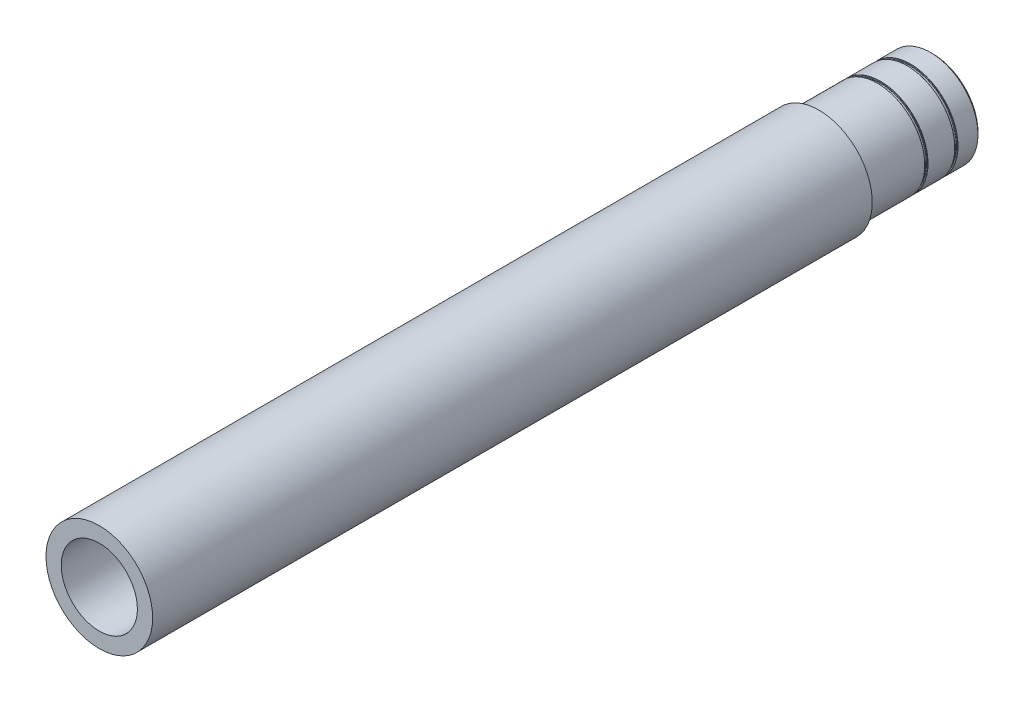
ISO-10303-21;
HEADER;
FILE_DESCRIPTION(('STEP AP214'),'2;1');
FILE_NAME('part.step','',(''),(''),'','','');
FILE_SCHEMA(('AUTOMOTIVE_DESIGN { 1 0 10303 214 1 1 1 1 }'));
ENDSEC;
DATA;
#1=APPLICATION_CONTEXT('core data for automotive mechanical design processes');
#2=APPLICATION_PROTOCOL_DEFINITION('international standard','automotive_design',2000,#1);
#3=PRODUCT_CONTEXT('',#1,'mechanical');
#4=PRODUCT('Part','Part','',(#3));
#5=PRODUCT_RELATED_PRODUCT_CATEGORY('part','',(#4));
#6=PRODUCT_DEFINITION_FORMATION('','',#4);
#7=PRODUCT_DEFINITION_CONTEXT('part definition',#1,'design');
#8=PRODUCT_DEFINITION('design','',#6,#7);
#9=PRODUCT_DEFINITION_SHAPE('','',#8);
#10=(LENGTH_UNIT() NAMED_UNIT(*) SI_UNIT(.MILLI.,.METRE.));
#11=(NAMED_UNIT(*) PLANE_ANGLE_UNIT() SI_UNIT($,.RADIAN.));
#12=(NAMED_UNIT(*) SI_UNIT($,.STERADIAN.) SOLID_ANGLE_UNIT());
#13=UNCERTAINTY_MEASURE_WITH_UNIT(LENGTH_MEASURE(1.E-05),#10,'distance_accuracy_value','');
#14=(GEOMETRIC_REPRESENTATION_CONTEXT(3) GLOBAL_UNCERTAINTY_ASSIGNED_CONTEXT((#13)) GLOBAL_UNIT_ASSIGNED_CONTEXT((#10,
#11,#12)) REPRESENTATION_CONTEXT('',''));
#15=CARTESIAN_POINT('',(0.,0.,0.));
#16=DIRECTION('',(0.,0.,1.));
#17=DIRECTION('',(1.,0.,0.));
#18=AXIS2_PLACEMENT_3D('',#15,#16,#17);
#19=CARTESIAN_POINT('',(0.,0.,100.));
#20=DIRECTION('',(0.,0.,-1.));
#21=DIRECTION('',(-1.,0.,0.));
#22=AXIS2_PLACEMENT_3D('',#19,#20,#21);
#23=CYLINDRICAL_SURFACE('',#22,39.6);
#24=CARTESIAN_POINT('',(0.,0.,6.99999999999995));
#25=DIRECTION('',(0.,0.,1.));
#26=DIRECTION('',(1.,0.,0.));
#27=AXIS2_PLACEMENT_3D('',#24,#25,#26);
#28=CIRCLE('',#27,39.6);
#29=CARTESIAN_POINT('',(39.6,0.,6.99999999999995));
#30=VERTEX_POINT('',#29);
#31=EDGE_CURVE('E11',#30,#30,#28,.T.);
#32=ORIENTED_EDGE('',*,*,#31,.T.);
#33=EDGE_LOOP('',(#32));
#34=FACE_BOUND('',#33,.T.);
#35=CARTESIAN_POINT('',(0.,0.,23.6411));
#36=DIRECTION('',(0.,0.,1.));
#37=DIRECTION('',(1.,0.,0.));
#38=AXIS2_PLACEMENT_3D('',#35,#36,#37);
#39=CIRCLE('',#38,39.6);
#40=CARTESIAN_POINT('',(39.6,0.,23.6411));
#41=VERTEX_POINT('',#40);
#42=EDGE_CURVE('E63',#41,#41,#39,.F.);
#43=ORIENTED_EDGE('',*,*,#42,.T.);
#44=EDGE_LOOP('',(#43));
#45=FACE_BOUND('',#44,.T.);
#46=ADVANCED_FACE('F33',(#34,#45),#23,.T.);
#47=CARTESIAN_POINT('',(0.,0.,26.3589));
#48=DIRECTION('',(0.,0.,-1.));
#49=DIRECTION('',(-1.,0.,0.));
#50=AXIS2_PLACEMENT_3D('',#47,#48,#49);
#51=CIRCLE('',#50,39.6);
#52=CARTESIAN_POINT('',(-39.6,0.,26.3589));
#53=VERTEX_POINT('',#52);
#54=EDGE_CURVE('E69',#53,#53,#51,.F.);
#55=ORIENTED_EDGE('',*,*,#54,.T.);
#56=EDGE_LOOP('',(#55));
#57=FACE_BOUND('',#56,.T.);
#58=CARTESIAN_POINT('',(0.,0.,48.6411));
#59=DIRECTION('',(0.,0.,1.));
#60=DIRECTION('',(1.,0.,0.));
#61=AXIS2_PLACEMENT_3D('',#58,#59,#60);
#62=CIRCLE('',#61,39.6);
#63=CARTESIAN_POINT('',(39.6,0.,48.6411));
#64=VERTEX_POINT('',#63);
#65=EDGE_CURVE('E72',#64,#64,#62,.F.);
#66=ORIENTED_EDGE('',*,*,#65,.T.);
#67=EDGE_LOOP('',(#66));
#68=FACE_BOUND('',#67,.T.);
#69=ADVANCED_FACE('F129',(#57,#68),#23,.T.);
#70=CARTESIAN_POINT('',(0.,0.,51.3589));
#71=DIRECTION('',(0.,0.,-1.));
#72=DIRECTION('',(-1.,0.,0.));
#73=AXIS2_PLACEMENT_3D('',#70,#71,#72);
#74=CIRCLE('',#73,39.6);
#75=CARTESIAN_POINT('',(-39.6,0.,51.3589));
#76=VERTEX_POINT('',#75);
#77=EDGE_CURVE('E48',#76,#76,#74,.F.);
#78=ORIENTED_EDGE('',*,*,#77,.T.);
#79=EDGE_LOOP('',(#78));
#80=FACE_BOUND('',#79,.T.);
#81=CARTESIAN_POINT('',(0.,0.,100.));
#82=DIRECTION('',(0.,0.,-1.));
#83=DIRECTION('',(-1.,0.,0.));
#84=AXIS2_PLACEMENT_3D('',#81,#82,#83);
#85=CIRCLE('',#84,39.6);
#86=CARTESIAN_POINT('',(-39.6,0.,100.));
#87=VERTEX_POINT('',#86);
#88=EDGE_CURVE('E80',#87,#87,#85,.T.);
#89=ORIENTED_EDGE('',*,*,#88,.T.);
#90=EDGE_LOOP('',(#89));
#91=FACE_BOUND('',#90,.T.);
#92=ADVANCED_FACE('F131',(#80,#91),#23,.T.);
#93=CARTESIAN_POINT('',(0.,0.,700.));
#94=DIRECTION('',(0.,0.,-1.));
#95=DIRECTION('',(-1.,0.,0.));
#96=AXIS2_PLACEMENT_3D('',#93,#94,#95);
#97=CYLINDRICAL_SURFACE('',#96,44.45);
#98=CARTESIAN_POINT('',(0.,0.,700.));
#99=DIRECTION('',(0.,0.,1.));
#100=DIRECTION('',(1.,0.,0.));
#101=AXIS2_PLACEMENT_3D('',#98,#99,#100);
#102=CIRCLE('',#101,44.45);
#103=CARTESIAN_POINT('',(44.45,0.,700.));
#104=VERTEX_POINT('',#103);
#105=EDGE_CURVE('E75',#104,#104,#102,.T.);
#106=ORIENTED_EDGE('',*,*,#105,.F.);
#107=EDGE_LOOP('',(#106));
#108=FACE_BOUND('',#107,.T.);
#109=CARTESIAN_POINT('',(0.,0.,100.));
#110=DIRECTION('',(0.,0.,-1.));
#111=DIRECTION('',(-1.,0.,0.));
#112=AXIS2_PLACEMENT_3D('',#109,#110,#111);
#113=CIRCLE('',#112,44.45);
#114=CARTESIAN_POINT('',(-44.45,0.,100.));
#115=VERTEX_POINT('',#114);
#116=EDGE_CURVE('E76',#115,#115,#113,.T.);
#117=ORIENTED_EDGE('',*,*,#116,.F.);
#118=EDGE_LOOP('',(#117));
#119=FACE_BOUND('',#118,.T.);
#120=ADVANCED_FACE('F140',(#108,#119),#97,.T.);
#121=CARTESIAN_POINT('',(0.,0.,700.));
#122=DIRECTION('',(0.,0.,1.));
#123=DIRECTION('',(1.,0.,0.));
#124=AXIS2_PLACEMENT_3D('',#121,#122,#123);
#125=PLANE('',#124);
#126=ORIENTED_EDGE('',*,*,#105,.T.);
#127=EDGE_LOOP('',(#126));
#128=FACE_BOUND('',#127,.T.);
#129=CARTESIAN_POINT('',(0.,0.,700.));
#130=DIRECTION('',(0.,0.,1.));
#131=DIRECTION('',(1.,0.,0.));
#132=AXIS2_PLACEMENT_3D('',#129,#130,#131);
#133=CIRCLE('',#132,31.75);
#134=CARTESIAN_POINT('',(31.75,0.,700.));
#135=VERTEX_POINT('',#134);
#136=EDGE_CURVE('E79',#135,#135,#133,.T.);
#137=ORIENTED_EDGE('',*,*,#136,.F.);
#138=EDGE_LOOP('',(#137));
#139=FACE_BOUND('',#138,.T.);
#140=ADVANCED_FACE('F145',(#128,#139),#125,.T.);
#141=CARTESIAN_POINT('',(0.,0.,700.));
#142=DIRECTION('',(0.,0.,-1.));
#143=DIRECTION('',(-1.,0.,0.));
#144=AXIS2_PLACEMENT_3D('',#141,#142,#143);
#145=CYLINDRICAL_SURFACE('',#144,31.75);
#146=CARTESIAN_POINT('',(0.,0.,5.));
#147=DIRECTION('',(0.,0.,1.));
#148=DIRECTION('',(1.,0.,0.));
#149=AXIS2_PLACEMENT_3D('',#146,#147,#148);
#150=CIRCLE('',#149,31.75);
#151=CARTESIAN_POINT('',(31.75,0.,5.));
#152=VERTEX_POINT('',#151);
#153=EDGE_CURVE('E51',#152,#152,#150,.T.);
#154=ORIENTED_EDGE('',*,*,#153,.F.);
#155=EDGE_LOOP('',(#154));
#156=FACE_BOUND('',#155,.T.);
#157=ORIENTED_EDGE('',*,*,#136,.T.);
#158=EDGE_LOOP('',(#157));
#159=FACE_BOUND('',#158,.T.);
#160=ADVANCED_FACE('F156',(#156,#159),#145,.F.);
#161=CARTESIAN_POINT('',(0.,0.,100.));
#162=DIRECTION('',(0.,0.,-1.));
#163=DIRECTION('',(-1.,0.,0.));
#164=AXIS2_PLACEMENT_3D('',#161,#162,#163);
#165=PLANE('',#164);
#166=ORIENTED_EDGE('',*,*,#88,.F.);
#167=EDGE_LOOP('',(#166));
#168=FACE_BOUND('',#167,.T.);
#169=ORIENTED_EDGE('',*,*,#116,.T.);
#170=EDGE_LOOP('',(#169));
#171=FACE_BOUND('',#170,.T.);
#172=ADVANCED_FACE('F152',(#168,#171),#165,.T.);
#173=CARTESIAN_POINT('',(0.,40.8446,48.8189));
#174=DIRECTION('',(0.,0.,1.));
#175=DIRECTION('',(1.,0.,0.));
#176=AXIS2_PLACEMENT_3D('',#173,#174,#175);
#177=PLANE('',#176);
#178=CARTESIAN_POINT('',(0.,0.,48.8189));
#179=DIRECTION('',(0.,0.,1.));
#180=DIRECTION('',(1.,0.,0.));
#181=AXIS2_PLACEMENT_3D('',#178,#179,#180);
#182=CIRCLE('',#181,39.4222);
#183=CARTESIAN_POINT('',(39.4222,0.,48.8189));
#184=VERTEX_POINT('',#183);
#185=EDGE_CURVE('E57',#184,#184,#182,.T.);
#186=ORIENTED_EDGE('',*,*,#185,.T.);
#187=EDGE_LOOP('',(#186));
#188=FACE_BOUND('',#187,.T.);
#189=CARTESIAN_POINT('',(0.,0.,48.8189));
#190=DIRECTION('',(0.,0.,1.));
#191=DIRECTION('',(1.,0.,0.));
#192=AXIS2_PLACEMENT_3D('',#189,#190,#191);
#193=CIRCLE('',#192,38.6094);
#194=CARTESIAN_POINT('',(38.6094,0.,48.8189));
#195=VERTEX_POINT('',#194);
#196=EDGE_CURVE('E87',#195,#195,#193,.T.);
#197=ORIENTED_EDGE('',*,*,#196,.F.);
#198=EDGE_LOOP('',(#197));
#199=FACE_BOUND('',#198,.T.);
#200=ADVANCED_FACE('F155',(#188,#199),#177,.T.);
#201=CARTESIAN_POINT('',(0.,0.,49.0729));
#202=DIRECTION('',(0.,0.,1.));
#203=DIRECTION('',(1.,0.,0.));
#204=AXIS2_PLACEMENT_3D('',#201,#202,#203);
#205=TOROIDAL_SURFACE('',#204,38.6094,0.253999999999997);
#206=ORIENTED_EDGE('',*,*,#196,.T.);
#207=EDGE_LOOP('',(#206));
#208=FACE_BOUND('',#207,.T.);
#209=CARTESIAN_POINT('',(0.,0.,49.0729));
#210=DIRECTION('',(0.,0.,1.));
#211=DIRECTION('',(1.,0.,0.));
#212=AXIS2_PLACEMENT_3D('',#209,#210,#211);
#213=CIRCLE('',#212,38.3554);
#214=CARTESIAN_POINT('',(38.3554,0.,49.0729));
#215=VERTEX_POINT('',#214);
#216=EDGE_CURVE('E90',#215,#215,#213,.T.);
#217=ORIENTED_EDGE('',*,*,#216,.F.);
#218=EDGE_LOOP('',(#217));
#219=FACE_BOUND('',#218,.T.);
#220=ADVANCED_FACE('F163',(#208,#219),#205,.F.);
#221=CARTESIAN_POINT('',(0.,0.,700.));
#222=DIRECTION('',(0.,0.,1.));
#223=DIRECTION('',(1.,0.,0.));
#224=AXIS2_PLACEMENT_3D('',#221,#222,#223);
#225=CYLINDRICAL_SURFACE('',#224,38.3554);
#226=ORIENTED_EDGE('',*,*,#216,.T.);
#227=EDGE_LOOP('',(#226));
#228=FACE_BOUND('',#227,.T.);
#229=CARTESIAN_POINT('',(0.,0.,50.9271));
#230=DIRECTION('',(0.,0.,1.));
#231=DIRECTION('',(1.,0.,0.));
#232=AXIS2_PLACEMENT_3D('',#229,#230,#231);
#233=CIRCLE('',#232,38.3554);
#234=CARTESIAN_POINT('',(38.3554,0.,50.9271));
#235=VERTEX_POINT('',#234);
#236=EDGE_CURVE('E93',#235,#235,#233,.T.);
#237=ORIENTED_EDGE('',*,*,#236,.F.);
#238=EDGE_LOOP('',(#237));
#239=FACE_BOUND('',#238,.T.);
#240=ADVANCED_FACE('F201',(#228,#239),#225,.T.);
#241=CARTESIAN_POINT('',(0.,0.,50.9271));
#242=DIRECTION('',(0.,0.,1.));
#243=DIRECTION('',(1.,0.,0.));
#244=AXIS2_PLACEMENT_3D('',#241,#242,#243);
#245=TOROIDAL_SURFACE('',#244,38.6094,0.253999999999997);
#246=ORIENTED_EDGE('',*,*,#236,.T.);
#247=EDGE_LOOP('',(#246));
#248=FACE_BOUND('',#247,.T.);
#249=CARTESIAN_POINT('',(0.,0.,51.1811));
#250=DIRECTION('',(0.,0.,1.));
#251=DIRECTION('',(1.,0.,0.));
#252=AXIS2_PLACEMENT_3D('',#249,#250,#251);
#253=CIRCLE('',#252,38.6094);
#254=CARTESIAN_POINT('',(38.6094,0.,51.1811));
#255=VERTEX_POINT('',#254);
#256=EDGE_CURVE('E96',#255,#255,#253,.T.);
#257=ORIENTED_EDGE('',*,*,#256,.F.);
#258=EDGE_LOOP('',(#257));
#259=FACE_BOUND('',#258,.T.);
#260=ADVANCED_FACE('F196',(#248,#259),#245,.F.);
#261=CARTESIAN_POINT('',(0.,40.8446,51.1811));
#262=DIRECTION('',(0.,0.,-1.));
#263=DIRECTION('',(-1.,0.,0.));
#264=AXIS2_PLACEMENT_3D('',#261,#262,#263);
#265=PLANE('',#264);
#266=CARTESIAN_POINT('',(0.,0.,51.1811));
#267=DIRECTION('',(0.,0.,-1.));
#268=DIRECTION('',(-1.,0.,0.));
#269=AXIS2_PLACEMENT_3D('',#266,#267,#268);
#270=CIRCLE('',#269,39.4222);
#271=CARTESIAN_POINT('',(-39.4222,0.,51.1811));
#272=VERTEX_POINT('',#271);
#273=EDGE_CURVE('E44',#272,#272,#270,.T.);
#274=ORIENTED_EDGE('',*,*,#273,.T.);
#275=EDGE_LOOP('',(#274));
#276=FACE_BOUND('',#275,.T.);
#277=ORIENTED_EDGE('',*,*,#256,.T.);
#278=EDGE_LOOP('',(#277));
#279=FACE_BOUND('',#278,.T.);
#280=ADVANCED_FACE('F192',(#276,#279),#265,.T.);
#281=CARTESIAN_POINT('',(0.,40.8446,23.8189));
#282=DIRECTION('',(0.,0.,1.));
#283=DIRECTION('',(1.,0.,0.));
#284=AXIS2_PLACEMENT_3D('',#281,#282,#283);
#285=PLANE('',#284);
#286=CARTESIAN_POINT('',(0.,0.,23.8189));
#287=DIRECTION('',(0.,0.,1.));
#288=DIRECTION('',(1.,0.,0.));
#289=AXIS2_PLACEMENT_3D('',#286,#287,#288);
#290=CIRCLE('',#289,39.4222);
#291=CARTESIAN_POINT('',(39.4222,0.,23.8189));
#292=VERTEX_POINT('',#291);
#293=EDGE_CURVE('E60',#292,#292,#290,.T.);
#294=ORIENTED_EDGE('',*,*,#293,.T.);
#295=EDGE_LOOP('',(#294));
#296=FACE_BOUND('',#295,.T.);
#297=CARTESIAN_POINT('',(0.,0.,23.8189));
#298=DIRECTION('',(0.,0.,1.));
#299=DIRECTION('',(1.,0.,0.));
#300=AXIS2_PLACEMENT_3D('',#297,#298,#299);
#301=CIRCLE('',#300,38.6094);
#302=CARTESIAN_POINT('',(38.6094,0.,23.8189));
#303=VERTEX_POINT('',#302);
#304=EDGE_CURVE('E99',#303,#303,#301,.T.);
#305=ORIENTED_EDGE('',*,*,#304,.F.);
#306=EDGE_LOOP('',(#305));
#307=FACE_BOUND('',#306,.T.);
#308=ADVANCED_FACE('F195',(#296,#307),#285,.T.);
#309=CARTESIAN_POINT('',(0.,0.,24.0729));
#310=DIRECTION('',(0.,0.,1.));
#311=DIRECTION('',(1.,0.,0.));
#312=AXIS2_PLACEMENT_3D('',#309,#310,#311);
#313=TOROIDAL_SURFACE('',#312,38.6094,0.253999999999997);
#314=ORIENTED_EDGE('',*,*,#304,.T.);
#315=EDGE_LOOP('',(#314));
#316=FACE_BOUND('',#315,.T.);
#317=CARTESIAN_POINT('',(0.,0.,24.0729000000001));
#318=DIRECTION('',(0.,0.,1.));
#319=DIRECTION('',(1.,0.,0.));
#320=AXIS2_PLACEMENT_3D('',#317,#318,#319);
#321=CIRCLE('',#320,38.3554);
#322=CARTESIAN_POINT('',(38.3554,0.,24.0729000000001));
#323=VERTEX_POINT('',#322);
#324=EDGE_CURVE('E102',#323,#323,#321,.T.);
#325=ORIENTED_EDGE('',*,*,#324,.F.);
#326=EDGE_LOOP('',(#325));
#327=FACE_BOUND('',#326,.T.);
#328=ADVANCED_FACE('F125',(#316,#327),#313,.F.);
#329=CARTESIAN_POINT('',(0.,0.,700.));
#330=DIRECTION('',(0.,0.,1.));
#331=DIRECTION('',(1.,0.,0.));
#332=AXIS2_PLACEMENT_3D('',#329,#330,#331);
#333=CYLINDRICAL_SURFACE('',#332,38.3554);
#334=ORIENTED_EDGE('',*,*,#324,.T.);
#335=EDGE_LOOP('',(#334));
#336=FACE_BOUND('',#335,.T.);
#337=CARTESIAN_POINT('',(0.,0.,25.9271));
#338=DIRECTION('',(0.,0.,1.));
#339=DIRECTION('',(1.,0.,0.));
#340=AXIS2_PLACEMENT_3D('',#337,#338,#339);
#341=CIRCLE('',#340,38.3554);
#342=CARTESIAN_POINT('',(38.3554,0.,25.9271));
#343=VERTEX_POINT('',#342);
#344=EDGE_CURVE('E105',#343,#343,#341,.T.);
#345=ORIENTED_EDGE('',*,*,#344,.F.);
#346=EDGE_LOOP('',(#345));
#347=FACE_BOUND('',#346,.T.);
#348=ADVANCED_FACE('F115',(#336,#347),#333,.T.);
#349=CARTESIAN_POINT('',(0.,0.,25.9271));
#350=DIRECTION('',(0.,0.,1.));
#351=DIRECTION('',(1.,0.,0.));
#352=AXIS2_PLACEMENT_3D('',#349,#350,#351);
#353=TOROIDAL_SURFACE('',#352,38.6094,0.253999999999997);
#354=ORIENTED_EDGE('',*,*,#344,.T.);
#355=EDGE_LOOP('',(#354));
#356=FACE_BOUND('',#355,.T.);
#357=CARTESIAN_POINT('',(0.,0.,26.1811000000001));
#358=DIRECTION('',(0.,0.,1.));
#359=DIRECTION('',(1.,0.,0.));
#360=AXIS2_PLACEMENT_3D('',#357,#358,#359);
#361=CIRCLE('',#360,38.6094);
#362=CARTESIAN_POINT('',(38.6094,0.,26.1811000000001));
#363=VERTEX_POINT('',#362);
#364=EDGE_CURVE('E53',#363,#363,#361,.T.);
#365=ORIENTED_EDGE('',*,*,#364,.F.);
#366=EDGE_LOOP('',(#365));
#367=FACE_BOUND('',#366,.T.);
#368=ADVANCED_FACE('F113',(#356,#367),#353,.F.);
#369=CARTESIAN_POINT('',(0.,40.8446,26.1811));
#370=DIRECTION('',(0.,0.,-1.));
#371=DIRECTION('',(-1.,0.,0.));
#372=AXIS2_PLACEMENT_3D('',#369,#370,#371);
#373=PLANE('',#372);
#374=CARTESIAN_POINT('',(0.,0.,26.1811));
#375=DIRECTION('',(0.,0.,-1.));
#376=DIRECTION('',(-1.,0.,0.));
#377=AXIS2_PLACEMENT_3D('',#374,#375,#376);
#378=CIRCLE('',#377,39.4222);
#379=CARTESIAN_POINT('',(-39.4222,0.,26.1811));
#380=VERTEX_POINT('',#379);
#381=EDGE_CURVE('E66',#380,#380,#378,.T.);
#382=ORIENTED_EDGE('',*,*,#381,.T.);
#383=EDGE_LOOP('',(#382));
#384=FACE_BOUND('',#383,.T.);
#385=ORIENTED_EDGE('',*,*,#364,.T.);
#386=EDGE_LOOP('',(#385));
#387=FACE_BOUND('',#386,.T.);
#388=ADVANCED_FACE('F111',(#384,#387),#373,.T.);
#389=CARTESIAN_POINT('',(0.,0.,26.3589));
#390=DIRECTION('',(0.,0.,-1.));
#391=DIRECTION('',(-1.,0.,0.));
#392=AXIS2_PLACEMENT_3D('',#389,#390,#391);
#393=TOROIDAL_SURFACE('',#392,39.4222,0.1778);
#394=ORIENTED_EDGE('',*,*,#381,.F.);
#395=EDGE_LOOP('',(#394));
#396=FACE_BOUND('',#395,.T.);
#397=ORIENTED_EDGE('',*,*,#54,.F.);
#398=EDGE_LOOP('',(#397));
#399=FACE_BOUND('',#398,.T.);
#400=ADVANCED_FACE('F122',(#396,#399),#393,.T.);
#401=CARTESIAN_POINT('',(0.,0.,23.6411));
#402=DIRECTION('',(0.,0.,1.));
#403=DIRECTION('',(1.,0.,0.));
#404=AXIS2_PLACEMENT_3D('',#401,#402,#403);
#405=TOROIDAL_SURFACE('',#404,39.4222,0.1778);
#406=ORIENTED_EDGE('',*,*,#293,.F.);
#407=EDGE_LOOP('',(#406));
#408=FACE_BOUND('',#407,.T.);
#409=ORIENTED_EDGE('',*,*,#42,.F.);
#410=EDGE_LOOP('',(#409));
#411=FACE_BOUND('',#410,.T.);
#412=ADVANCED_FACE('F173',(#408,#411),#405,.T.);
#413=CARTESIAN_POINT('',(0.,0.,48.6411));
#414=DIRECTION('',(0.,0.,1.));
#415=DIRECTION('',(1.,0.,0.));
#416=AXIS2_PLACEMENT_3D('',#413,#414,#415);
#417=TOROIDAL_SURFACE('',#416,39.4222,0.1778);
#418=ORIENTED_EDGE('',*,*,#185,.F.);
#419=EDGE_LOOP('',(#418));
#420=FACE_BOUND('',#419,.T.);
#421=ORIENTED_EDGE('',*,*,#65,.F.);
#422=EDGE_LOOP('',(#421));
#423=FACE_BOUND('',#422,.T.);
#424=ADVANCED_FACE('F177',(#420,#423),#417,.T.);
#425=CARTESIAN_POINT('',(0.,0.,51.3589));
#426=DIRECTION('',(0.,0.,-1.));
#427=DIRECTION('',(-1.,0.,0.));
#428=AXIS2_PLACEMENT_3D('',#425,#426,#427);
#429=TOROIDAL_SURFACE('',#428,39.4222,0.1778);
#430=ORIENTED_EDGE('',*,*,#273,.F.);
#431=EDGE_LOOP('',(#430));
#432=FACE_BOUND('',#431,.T.);
#433=ORIENTED_EDGE('',*,*,#77,.F.);
#434=EDGE_LOOP('',(#433));
#435=FACE_BOUND('',#434,.T.);
#436=ADVANCED_FACE('F180',(#432,#435),#429,.T.);
#437=CARTESIAN_POINT('',(0.,0.,5.));
#438=DIRECTION('',(0.,0.,1.));
#439=DIRECTION('',(1.,0.,0.));
#440=AXIS2_PLACEMENT_3D('',#437,#438,#439);
#441=PLANE('',#440);
#442=CARTESIAN_POINT('',(0.,0.,5.));
#443=DIRECTION('',(0.,0.,1.));
#444=DIRECTION('',(1.,0.,0.));
#445=AXIS2_PLACEMENT_3D('',#442,#443,#444);
#446=CIRCLE('',#445,37.6);
#447=CARTESIAN_POINT('',(37.6,0.,5.));
#448=VERTEX_POINT('',#447);
#449=EDGE_CURVE('E40',#448,#448,#446,.F.);
#450=ORIENTED_EDGE('',*,*,#449,.T.);
#451=EDGE_LOOP('',(#450));
#452=FACE_BOUND('',#451,.T.);
#453=ORIENTED_EDGE('',*,*,#153,.T.);
#454=EDGE_LOOP('',(#453));
#455=FACE_BOUND('',#454,.T.);
#456=ADVANCED_FACE('F183',(#452,#455),#441,.F.);
#457=CARTESIAN_POINT('',(0.,0.,5.));
#458=DIRECTION('',(0.,0.,1.));
#459=DIRECTION('',(1.,0.,0.));
#460=AXIS2_PLACEMENT_3D('',#457,#458,#459);
#461=CONICAL_SURFACE('',#460,37.6,0.785398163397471);
#462=ORIENTED_EDGE('',*,*,#31,.F.);
#463=EDGE_LOOP('',(#462));
#464=FACE_BOUND('',#463,.T.);
#465=ORIENTED_EDGE('',*,*,#449,.F.);
#466=EDGE_LOOP('',(#465));
#467=FACE_BOUND('',#466,.T.);
#468=ADVANCED_FACE('F35',(#464,#467),#461,.T.);
#469=CLOSED_SHELL('',(#46,#69,#92,#120,#140,#160,#172,#200,#220,#240,#260,#280,#308,#328,#348,
#368,#388,#400,#412,#424,#436,#456,#468));
#470=MANIFOLD_SOLID_BREP('B2',#469);
#471=ADVANCED_BREP_SHAPE_REPRESENTATION('',(#18,#470),#14);
#472=SHAPE_DEFINITION_REPRESENTATION(#9,#471);
ENDSEC;
END-ISO-10303-21;
